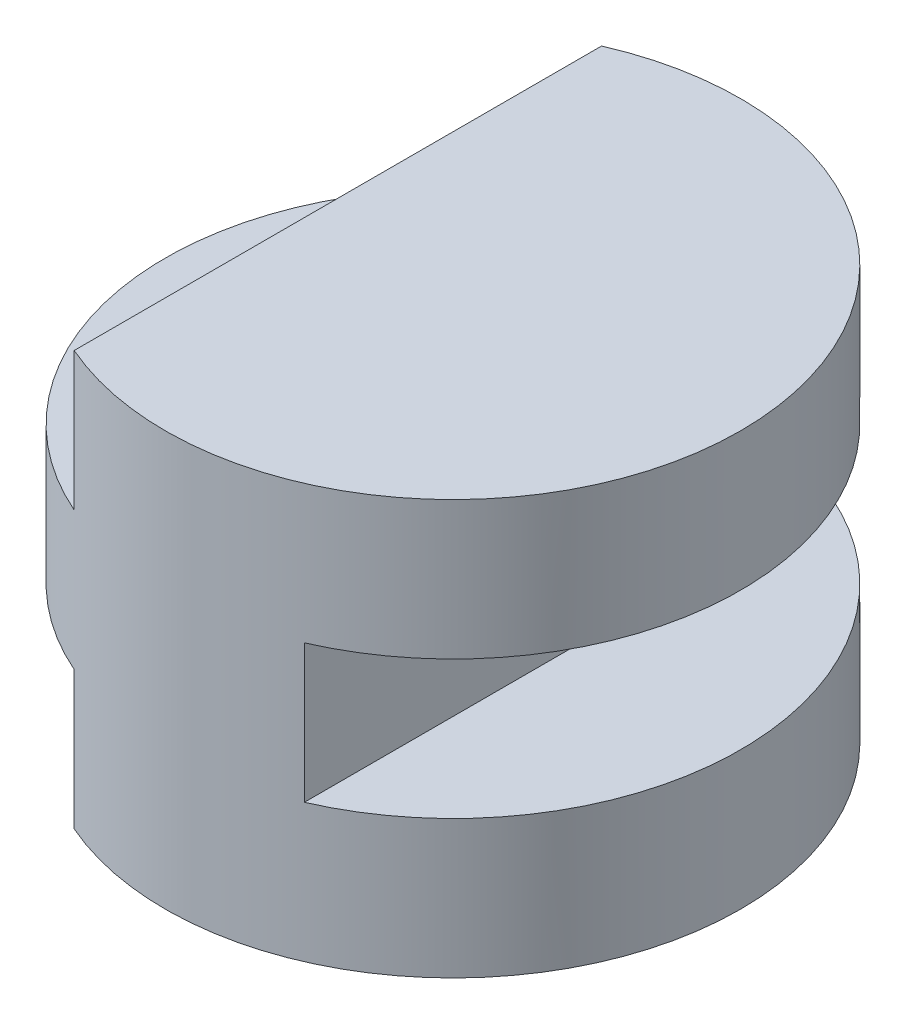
from build123d import *

# Parameters (mm, degrees)
SKETCH_2_R          = 50
EXTRUDE_1_DEPTH     = 72
SKETCH_3_W          = 54.022988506
SKETCH_3_H          = 30.574712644
SKETCH_3_W_2        = 45.517241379
SKETCH_3_H_2        = 24
CUT_EXTRUDE_1_DEPTH = 50


with BuildPart() as part:
    # Sketch 2 → Extrude 1 (new body)
    with BuildSketch(Plane(origin=(0, 0, 0), x_dir=(1, 0, 0), z_dir=(0, 1, 0))):
        with Locations(Location((0, 0, 0), (0, 0, 270))):
            Circle(SKETCH_2_R)
    extrude(amount=EXTRUDE_1_DEPTH)

    # Sketch 3 → Cut-Extrude 1 (cut, symmetric)
    with BuildSketch(Plane.XY):
        with Locations((-47.011494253, 8.712643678)):
            Rectangle(SKETCH_3_W, SKETCH_3_H)
        with Locations((42.758620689, 36)):
            Rectangle(SKETCH_3_W_2, SKETCH_3_H_2)
        with Locations((-47.011494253, 63.287356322)):
            Rectangle(SKETCH_3_W, SKETCH_3_H)
    extrude(amount=CUT_EXTRUDE_1_DEPTH, both=True, mode=Mode.SUBTRACT)


solid = part.part
